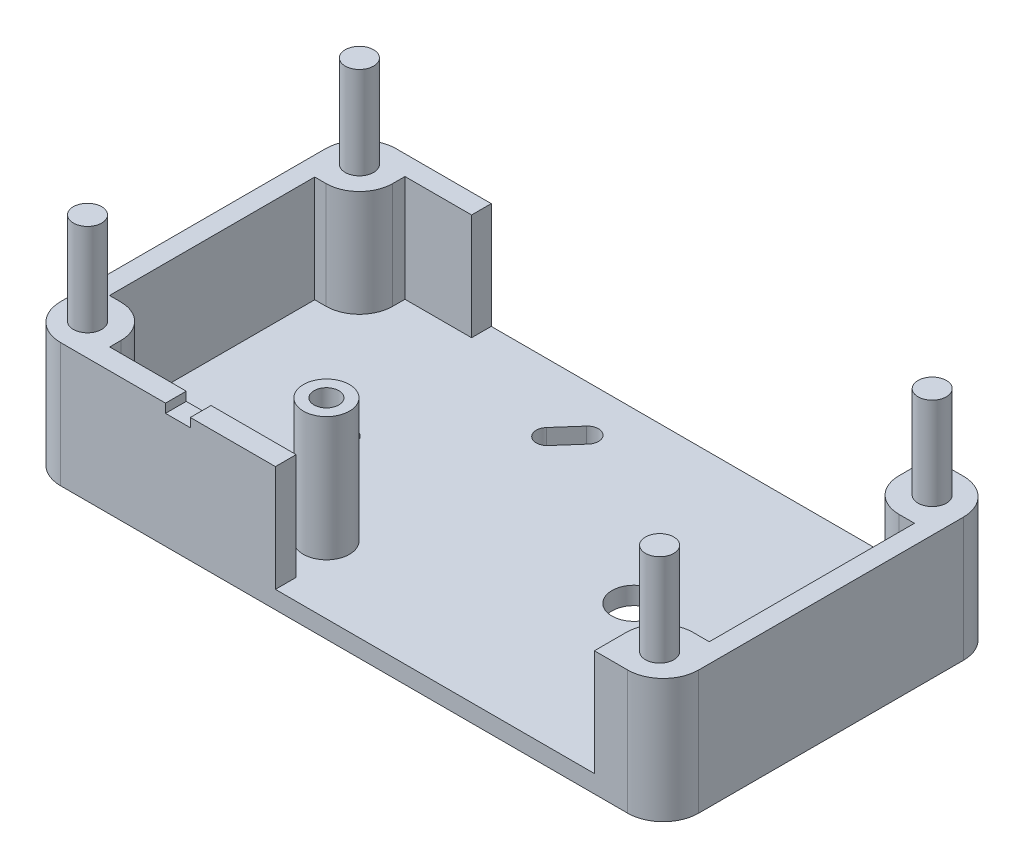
from build123d import *

# Parameters (mm, degrees)
SKETCH1_W           = 45.72
SKETCH1_H           = 24.0538
BOSS_EXTRUDE1_DEPTH = 8.89
FILLET1_R           = 2.54
SKETCH2_W           = 42.9768
SKETCH2_H           = 14.7066
CUT_EXTRUDE1_DEPTH  = 7.62
SKETCH4_W           = 22.86
SKETCH4_H           = 7.62
CUT_EXTRUDE3_DEPTH  = 7.366
SKETCH3_W           = 31.496
SKETCH3_H           = 7.62
CUT_EXTRUDE4_DEPTH  = 7.366
FILLET3_R           = 2.3876
SKETCH5_W           = 15.24
SKETCH5_H           = 21.1582
CUT_EXTRUDE5_DEPTH  = 7.62
FILLET4_R           = 2.3876
SKETCH6_R           = 1.016
BOSS_EXTRUDE2_DEPTH = 6.604
SKETCH7_W           = 1.778
SKETCH7_H           = 0.635
CUT_EXTRUDE6_DEPTH  = 26.67
SKETCH8_R           = 1.5875
CUT_EXTRUDE7_DEPTH  = 26.67
SKETCH9_R           = 1.5875
CUT_EXTRUDE8_DEPTH  = 26.67
SKETCH10_R          = 0.79375
CUT_EXTRUDE9_DEPTH  = 26.67
SKETCH11_R          = 1.651
SKETCH11_R_2        = 0.889
BOSS_EXTRUDE3_DEPTH = 8.89
CUT_EXTRUDE10_START = -7.62
SKETCH12_R          = 0.889
CUT_EXTRUDE10_DEPTH = 7.62


with BuildPart() as part:
    # Sketch1 → Boss-Extrude1 (new body)
    with BuildSketch(Plane(origin=(0, 0, 0), x_dir=(1, 0, 0), z_dir=(0, 1, 0))):
        Rectangle(SKETCH1_W, SKETCH1_H)
    extrude(amount=BOSS_EXTRUDE1_DEPTH)

    # Fillet1
    fillet1_edges = [part.edges().sort_by_distance(p)[0] for p in [
        (22.86, 4.445, 12.0269),
        (-22.86, 4.445, 12.0269),
        (-22.86, 4.445, -12.0269),
        (22.86, 4.445, -12.0269),
    ]]
    fillet(fillet1_edges, radius=FILLET1_R)

    # Sketch2 → Cut-Extrude1 (cut)
    with BuildSketch(Plane(origin=(0, 8.89, 0), x_dir=(1, 0, 0), z_dir=(0, 1, 0))):
        Rectangle(SKETCH2_W, SKETCH2_H)
    extrude(amount=-CUT_EXTRUDE1_DEPTH, mode=Mode.SUBTRACT)

    # Sketch4 → Cut-Extrude3 (cut)
    with BuildSketch(Plane.XY.offset(12.0269)):
        with Locations((6.5024, 5.08)):
            Rectangle(SKETCH4_W, SKETCH4_H)
    extrude(amount=-CUT_EXTRUDE3_DEPTH, mode=Mode.SUBTRACT)

    # Sketch3 → Cut-Extrude4 (cut)
    with BuildSketch(Plane(origin=(0, 0, -12.0269), x_dir=(-1, 0, 0), z_dir=(0, 0, -1))):
        with Locations((-2.2352, 5.08)):
            Rectangle(SKETCH3_W, SKETCH3_H)
    extrude(amount=-CUT_EXTRUDE4_DEPTH, mode=Mode.SUBTRACT)

    # Fillet3
    fillet3_edges = [part.edges().sort_by_distance(p)[0] for p in [
        (17.9324, 5.08, 7.3533),
        (17.9832, 5.08, -7.3533),
    ]]
    fillet(fillet3_edges, radius=FILLET3_R)

    # Sketch5 → Cut-Extrude5 (cut)
    with BuildSketch(Plane(origin=(0, 8.89, 0), x_dir=(1, 0, 0), z_dir=(0, 1, 0))):
        with Locations((-10.668, 0.0381)):
            Rectangle(SKETCH5_W, SKETCH5_H)
    extrude(amount=-CUT_EXTRUDE5_DEPTH, mode=Mode.SUBTRACT)

    # Fillet4
    fillet4_edges = [part.edges().sort_by_distance(p)[0] for p in [
        (-18.288, 5.08, 7.3533),
        (-18.288, 5.08, -7.3533),
    ]]
    fillet(fillet4_edges, radius=FILLET4_R)

    # Sketch6 → Boss-Extrude2 (add)
    with BuildSketch(Plane(origin=(0, 8.89, 0), x_dir=(1, 0, 0), z_dir=(0, 1, 0))):
        with Locations(Location((-20.6756, 9.7409, 0), (0, 0, 90))):
            Circle(SKETCH6_R)
        with Locations(Location((20.3708, 9.7409, 0), (0, 0, 90))):
            Circle(SKETCH6_R)
        with Locations(Location((20.32, -9.7409, 0), (0, 0, 90))):
            Circle(SKETCH6_R)
        with Locations(Location((-20.6756, -9.7409, 0), (0, 0, 90))):
            Circle(SKETCH6_R)
    extrude(amount=BOSS_EXTRUDE2_DEPTH)

    # Sketch7 → Cut-Extrude6 (cut)
    with BuildSketch(Plane.XY.offset(12.0269)):
        with Locations((-11.9126, 8.5725)):
            Rectangle(SKETCH7_W, SKETCH7_H)
    extrude(amount=-CUT_EXTRUDE6_DEPTH, mode=Mode.SUBTRACT)

    # Sketch8 → Cut-Extrude7 (cut)
    with BuildSketch(Plane(origin=(0, 1.27, 0), x_dir=(1, 0, 0), z_dir=(0, 1, 0))):
        with Locations(Location((8.7884, -0.0381, 0), (0, 0, 270))):
            Circle(SKETCH8_R)
    extrude(amount=-CUT_EXTRUDE7_DEPTH, mode=Mode.SUBTRACT)

    # Sketch9 → Cut-Extrude8 (cut)
    with BuildSketch(Plane(origin=(0, 1.27, 0), x_dir=(1, 0, 0), z_dir=(0, 1, 0))):
        with Locations(Location((8.7884, -0.0381, 0), (0, 0, 270))):
            Circle(SKETCH9_R)
        with BuildLine():
            Line((-5.262833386, 7.725916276), (-3.91879172, 9.249916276))
            ThreePointArc((-3.91879172, 9.249916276), (-2.798462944, 9.3202125), (-2.72816672, 8.199883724))
            Line((-2.72816672, 8.199883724), (-4.072208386, 6.675883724))
            ThreePointArc((-4.072208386, 6.675883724), (-5.192537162, 6.6055875), (-5.262833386, 7.725916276))
        make_face()
    extrude(amount=-CUT_EXTRUDE8_DEPTH, mode=Mode.SUBTRACT)

    # Sketch10 → Cut-Extrude9 (cut)
    with BuildSketch(Plane(origin=(0, 1.27, 0), x_dir=(1, 0, 0), z_dir=(0, 1, 0))):
        with Locations(Location((-11.959356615, -0.0381, 0), (0, 0, 270))):
            Circle(SKETCH10_R)
    extrude(amount=-CUT_EXTRUDE9_DEPTH, mode=Mode.SUBTRACT)

    # Sketch11 → Boss-Extrude3 (add)
    with BuildSketch(Plane(origin=(0, 1.27, 0), x_dir=(1, 0, 0), z_dir=(0, 1, 0))):
        with Locations(Location((-6.096, -7.2009, 0), (0, 0, 270))):
            Circle(SKETCH11_R)
        with Locations(Location((-6.096, -7.2009, 0), (0, 0, 270))):
            Circle(SKETCH11_R_2, mode=Mode.SUBTRACT)
    extrude(amount=BOSS_EXTRUDE3_DEPTH)

    # Sketch12 → Cut-Extrude10 (cut)
    with BuildSketch(Plane(origin=(0, 1.27, 0), x_dir=(1, 0, 0), z_dir=(0, 1, 0)).offset(CUT_EXTRUDE10_START)):
        with Locations(Location((-6.096, -7.2009, 0), (0, 0, 270))):
            Circle(SKETCH12_R)
    extrude(amount=CUT_EXTRUDE10_DEPTH, mode=Mode.SUBTRACT)


solid = part.part
